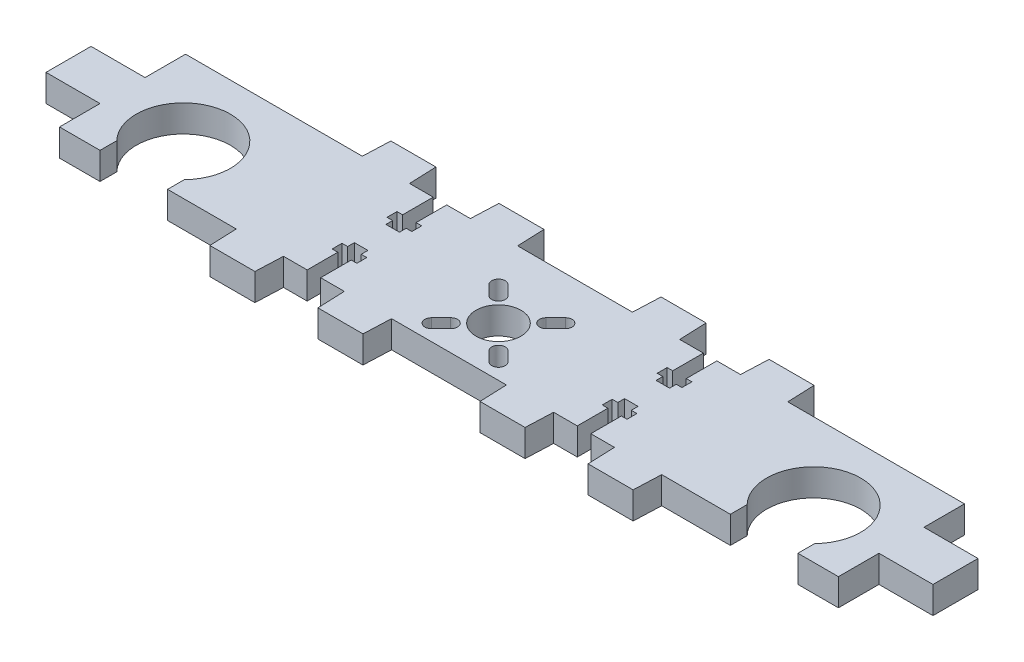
from build123d import *
from build123d.topology import SkipClean

# Parameters (mm, degrees)
EXTRUDE_1_DEPTH = 6


with BuildPart() as part:
    # Sketch 1 → Extrude 1 (new body)
    with BuildSketch(Plane(origin=(0, 0, 0), x_dir=(1, 0, 0), z_dir=(0, 1, 0))):
        with BuildLine():
            Line((0, -11), (12.75, -11))
            Line((12.75, -11), (13, -17.1))
            Line((13, -17.1), (23, -17.1))
            Line((23, -17.1), (23.25, -11))
            Line((23.25, -11), (28.5, -11))
            Line((28.5, -11), (28.5, -4.2))
            Line((28.5, -4.2), (27.25, -4.2))
            Line((27.25, -4.2), (27.25, -2))
            Line((27.25, -2), (28.5, -2))
            Line((28.5, -2), (28.5, -0.5))
            Line((28.5, -0.5), (31.5, -0.5))
            Line((31.5, -0.5), (31.5, -2))
            Line((31.5, -2), (32.75, -2))
            Line((32.75, -2), (32.75, -4.2))
            Line((32.75, -4.2), (31.5, -4.2))
            Line((31.5, -4.2), (31.5, -11))
            Line((31.5, -11), (36.75, -11))
            Line((36.75, -11), (37, -17.1))
            Line((37, -17.1), (47, -17.1))
            Line((47, -17.1), (47.25, -11))
            Line((47.25, -11), (62.5, -11))
            Line((62.5, -11), (62.5, -7.276846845))
            ThreePointArc((62.5, -7.276846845), (70, 10.45), (77.5, -7.276846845))
            Line((77.5, -7.276846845), (77.5, -11))
            Line((77.5, -11), (86.5, -11))
            Line((86.5, -11), (86.5, -2))
            Line((86.5, -2), (98.5, -2))
            Line((98.5, -2), (98.5, 8))
            Line((98.5, 8), (86.5, 8))
            Line((86.5, 8), (86.5, 17))
            Line((86.5, 17), (47.25, 17))
            Line((47.25, 17), (47, 23.1))
            Line((47, 23.1), (37, 23.1))
            Line((37, 23.1), (36.75, 17))
            Line((36.75, 17), (31.5, 17))
            Line((31.5, 17), (31.5, 10.2))
            Line((31.5, 10.2), (32.75, 10.2))
            Line((32.75, 10.2), (32.75, 8))
            Line((32.75, 8), (31.5, 8))
            Line((31.5, 8), (31.5, 6.5))
            Line((31.5, 6.5), (28.5, 6.5))
            Line((28.5, 6.5), (28.5, 8))
            Line((28.5, 8), (27.25, 8))
            Line((27.25, 8), (27.25, 10.2))
            Line((27.25, 10.2), (28.5, 10.2))
            Line((28.5, 10.2), (28.5, 17))
            Line((28.5, 17), (23.25, 17))
            Line((23.25, 17), (23, 23.1))
            Line((23, 23.1), (13, 23.1))
            Line((13, 23.1), (12.75, 17))
            Line((12.75, 17), (0, 17))
            Line((0, 17), (0, 5))
            ThreePointArc((0, 5), (5, 0), (0, -5))
            Line((0, -5), (0, -11))
        make_face()
        with BuildLine():
            Line((4.242640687, 6.363961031), (6.363961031, 8.485281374))
            ThreePointArc((6.363961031, 8.485281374), (8.485281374, 8.485281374), (8.485281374, 6.363961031))
            Line((8.485281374, 6.363961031), (6.363961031, 4.242640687))
            ThreePointArc((6.363961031, 4.242640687), (4.242640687, 4.242640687), (4.242640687, 6.363961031))
        make_face(mode=Mode.SUBTRACT)
        with BuildLine():
            Line((4.242640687, -6.363961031), (6.363961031, -8.485281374))
            ThreePointArc((6.363961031, -8.485281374), (8.485281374, -8.485281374), (8.485281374, -6.363961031))
            Line((8.485281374, -6.363961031), (6.363961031, -4.242640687))
            ThreePointArc((6.363961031, -4.242640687), (4.242640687, -4.242640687), (4.242640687, -6.363961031))
        make_face(mode=Mode.SUBTRACT)
    extrude(amount=EXTRUDE_1_DEPTH)

    # Mirror 1: part across plane


with BuildPart() as part_1:
    with SkipClean():  # the faces are left unmerged after this step: merging them gives an invalid solid
        add(part.part)
        add(part.part.mirror(Plane(origin=(0, 6, -17), x_dir=(0, 0, 1), z_dir=(1, 0, 0))))


solid = part_1.part
